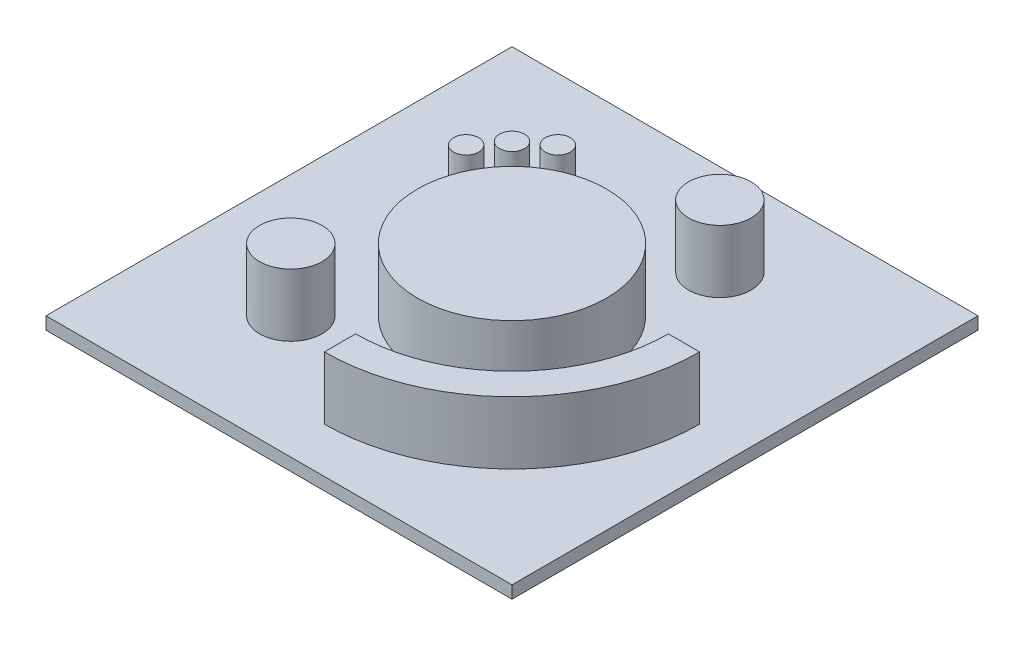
from build123d import *

# Parameters (mm, degrees)
SKETCH1_W      = 94.592545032
SKETCH1_H      = 94.592545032
EXTRUDE1_DEPTH = 2.54
SKETCH2_R      = 19.185004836
SKETCH2_R_2    = 2.54
SKETCH2_R_3    = 6.35
EXTRUDE2_DEPTH = 12.7


with BuildPart() as part:
    # Sketch1 → Extrude1 (new body)
    with BuildSketch(Plane(origin=(0, 0, 0), x_dir=(1, 0, 0), z_dir=(0, 1, 0))):
        Rectangle(SKETCH1_W, SKETCH1_H)
    extrude(amount=EXTRUDE1_DEPTH)

    # Sketch2 → Extrude2 (add)
    with BuildSketch(Plane(origin=(0, 2.54, 0), x_dir=(-1, 0, 0), z_dir=(0, 1, 0))):
        with Locations(Location((0, 0, 0), (0, 0, 270))):
            Circle(SKETCH2_R)
        with Locations(Location((12.7, -21.997045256, 0), (0, 0, 270))):
            Circle(SKETCH2_R_2)
        with Locations(Location((17.960512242, -17.960512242, 0), (0, 0, 270))):
            Circle(SKETCH2_R_2)
        with Locations(Location((21.997045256, -12.7, 0), (0, 0, 270))):
            Circle(SKETCH2_R_2)
        with Locations(Location((-13.41812981, -28.775272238, 0), (0, 0, 270))):
            Circle(SKETCH2_R_3)
        with Locations(Location((22.450640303, 22.450640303, 0), (0, 0, 270))):
            Circle(SKETCH2_R_3)
        with BuildLine():
            Line((0, 31.75), (0, 38.1))
            ThreePointArc((0, 38.1), (-26.940768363, 26.940768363), (-38.1, 0))
            Line((-38.1, 0), (-31.75, 0))
            ThreePointArc((-31.75, 0), (-22.450640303, 22.450640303), (0, 31.75))
        make_face()
    extrude(amount=EXTRUDE2_DEPTH)


solid = part.part
